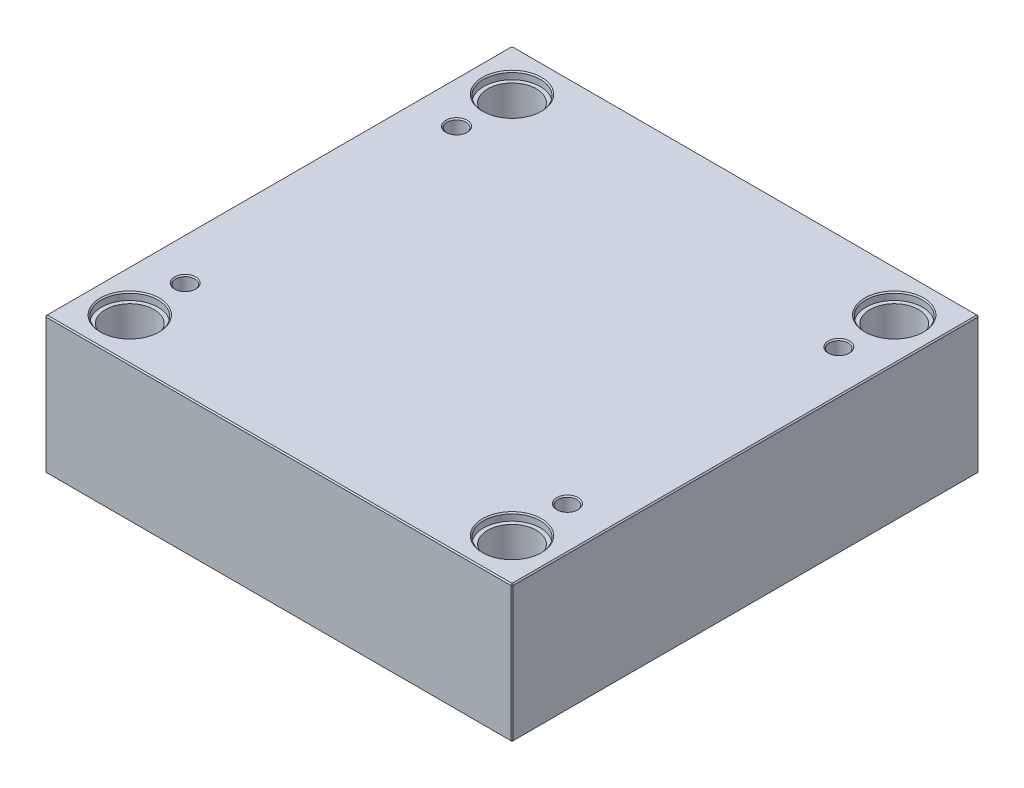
ISO-10303-21;
HEADER;
FILE_DESCRIPTION(('STEP AP214'),'2;1');
FILE_NAME('part.step','',(''),(''),'','','');
FILE_SCHEMA(('AUTOMOTIVE_DESIGN { 1 0 10303 214 1 1 1 1 }'));
ENDSEC;
DATA;
#1=APPLICATION_CONTEXT('core data for automotive mechanical design processes');
#2=APPLICATION_PROTOCOL_DEFINITION('international standard','automotive_design',2000,#1);
#3=PRODUCT_CONTEXT('',#1,'mechanical');
#4=PRODUCT('Part','Part','',(#3));
#5=PRODUCT_RELATED_PRODUCT_CATEGORY('part','',(#4));
#6=PRODUCT_DEFINITION_FORMATION('','',#4);
#7=PRODUCT_DEFINITION_CONTEXT('part definition',#1,'design');
#8=PRODUCT_DEFINITION('design','',#6,#7);
#9=PRODUCT_DEFINITION_SHAPE('','',#8);
#10=(LENGTH_UNIT() NAMED_UNIT(*) SI_UNIT(.MILLI.,.METRE.));
#11=(NAMED_UNIT(*) PLANE_ANGLE_UNIT() SI_UNIT($,.RADIAN.));
#12=(NAMED_UNIT(*) SI_UNIT($,.STERADIAN.) SOLID_ANGLE_UNIT());
#13=UNCERTAINTY_MEASURE_WITH_UNIT(LENGTH_MEASURE(1.E-05),#10,'distance_accuracy_value','');
#14=(GEOMETRIC_REPRESENTATION_CONTEXT(3) GLOBAL_UNCERTAINTY_ASSIGNED_CONTEXT((#13)) GLOBAL_UNIT_ASSIGNED_CONTEXT((#10,
#11,#12)) REPRESENTATION_CONTEXT('',''));
#15=CARTESIAN_POINT('',(0.,0.,0.));
#16=DIRECTION('',(0.,0.,1.));
#17=DIRECTION('',(1.,0.,0.));
#18=AXIS2_PLACEMENT_3D('',#15,#16,#17);
#19=CARTESIAN_POINT('',(-162.,0.,-162.));
#20=DIRECTION('',(0.,1.,0.));
#21=DIRECTION('',(0.,0.,1.));
#22=AXIS2_PLACEMENT_3D('',#19,#20,#21);
#23=CYLINDRICAL_SURFACE('',#22,20.65);
#24=CARTESIAN_POINT('',(-162.,0.999999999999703,-162.));
#25=DIRECTION('',(0.,1.,0.));
#26=DIRECTION('',(0.,0.,1.));
#27=AXIS2_PLACEMENT_3D('',#24,#25,#26);
#28=CIRCLE('',#27,20.65);
#29=CARTESIAN_POINT('',(-162.,0.999999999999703,-141.35));
#30=VERTEX_POINT('',#29);
#31=EDGE_CURVE('E472',#30,#30,#28,.F.);
#32=ORIENTED_EDGE('',*,*,#31,.T.);
#33=EDGE_LOOP('',(#32));
#34=FACE_BOUND('',#33,.T.);
#35=CARTESIAN_POINT('',(-162.,109.7,-162.));
#36=DIRECTION('',(0.,1.,0.));
#37=DIRECTION('',(0.,0.,1.));
#38=AXIS2_PLACEMENT_3D('',#35,#36,#37);
#39=CIRCLE('',#38,20.65);
#40=CARTESIAN_POINT('',(-162.,109.7,-141.35));
#41=VERTEX_POINT('',#40);
#42=EDGE_CURVE('E221',#41,#41,#39,.F.);
#43=ORIENTED_EDGE('',*,*,#42,.F.);
#44=EDGE_LOOP('',(#43));
#45=FACE_BOUND('',#44,.T.);
#46=ADVANCED_FACE('F16',(#34,#45),#23,.F.);
#47=CARTESIAN_POINT('',(162.,0.,-162.));
#48=DIRECTION('',(0.,1.,0.));
#49=DIRECTION('',(0.,0.,1.));
#50=AXIS2_PLACEMENT_3D('',#47,#48,#49);
#51=CYLINDRICAL_SURFACE('',#50,20.65);
#52=CARTESIAN_POINT('',(162.,0.999999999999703,-162.));
#53=DIRECTION('',(0.,1.,0.));
#54=DIRECTION('',(0.,0.,1.));
#55=AXIS2_PLACEMENT_3D('',#52,#53,#54);
#56=CIRCLE('',#55,20.65);
#57=CARTESIAN_POINT('',(162.,0.999999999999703,-141.35));
#58=VERTEX_POINT('',#57);
#59=EDGE_CURVE('E474',#58,#58,#56,.F.);
#60=ORIENTED_EDGE('',*,*,#59,.T.);
#61=EDGE_LOOP('',(#60));
#62=FACE_BOUND('',#61,.T.);
#63=CARTESIAN_POINT('',(162.,109.7,-162.));
#64=DIRECTION('',(0.,1.,0.));
#65=DIRECTION('',(0.,0.,1.));
#66=AXIS2_PLACEMENT_3D('',#63,#64,#65);
#67=CIRCLE('',#66,20.65);
#68=CARTESIAN_POINT('',(162.,109.7,-141.35));
#69=VERTEX_POINT('',#68);
#70=EDGE_CURVE('E218',#69,#69,#67,.F.);
#71=ORIENTED_EDGE('',*,*,#70,.F.);
#72=EDGE_LOOP('',(#71));
#73=FACE_BOUND('',#72,.T.);
#74=ADVANCED_FACE('F263',(#62,#73),#51,.F.);
#75=CARTESIAN_POINT('',(162.,0.,162.));
#76=DIRECTION('',(0.,1.,0.));
#77=DIRECTION('',(0.,0.,1.));
#78=AXIS2_PLACEMENT_3D('',#75,#76,#77);
#79=CYLINDRICAL_SURFACE('',#78,20.65);
#80=CARTESIAN_POINT('',(162.,0.999999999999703,162.));
#81=DIRECTION('',(0.,1.,0.));
#82=DIRECTION('',(0.,0.,1.));
#83=AXIS2_PLACEMENT_3D('',#80,#81,#82);
#84=CIRCLE('',#83,20.65);
#85=CARTESIAN_POINT('',(162.,0.999999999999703,182.65));
#86=VERTEX_POINT('',#85);
#87=EDGE_CURVE('E477',#86,#86,#84,.F.);
#88=ORIENTED_EDGE('',*,*,#87,.T.);
#89=EDGE_LOOP('',(#88));
#90=FACE_BOUND('',#89,.T.);
#91=CARTESIAN_POINT('',(162.,109.7,162.));
#92=DIRECTION('',(0.,1.,0.));
#93=DIRECTION('',(0.,0.,1.));
#94=AXIS2_PLACEMENT_3D('',#91,#92,#93);
#95=CIRCLE('',#94,20.65);
#96=CARTESIAN_POINT('',(162.,109.7,182.65));
#97=VERTEX_POINT('',#96);
#98=EDGE_CURVE('E214',#97,#97,#95,.F.);
#99=ORIENTED_EDGE('',*,*,#98,.F.);
#100=EDGE_LOOP('',(#99));
#101=FACE_BOUND('',#100,.T.);
#102=ADVANCED_FACE('F270',(#90,#101),#79,.F.);
#103=CARTESIAN_POINT('',(-162.,0.,162.));
#104=DIRECTION('',(0.,1.,0.));
#105=DIRECTION('',(0.,0.,1.));
#106=AXIS2_PLACEMENT_3D('',#103,#104,#105);
#107=CYLINDRICAL_SURFACE('',#106,20.65);
#108=CARTESIAN_POINT('',(-162.,0.999999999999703,162.));
#109=DIRECTION('',(0.,1.,0.));
#110=DIRECTION('',(0.,0.,1.));
#111=AXIS2_PLACEMENT_3D('',#108,#109,#110);
#112=CIRCLE('',#111,20.65);
#113=CARTESIAN_POINT('',(-162.,0.999999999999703,182.65));
#114=VERTEX_POINT('',#113);
#115=EDGE_CURVE('E480',#114,#114,#112,.F.);
#116=ORIENTED_EDGE('',*,*,#115,.T.);
#117=EDGE_LOOP('',(#116));
#118=FACE_BOUND('',#117,.T.);
#119=CARTESIAN_POINT('',(-162.,109.7,162.));
#120=DIRECTION('',(0.,1.,0.));
#121=DIRECTION('',(0.,0.,1.));
#122=AXIS2_PLACEMENT_3D('',#119,#120,#121);
#123=CIRCLE('',#122,20.65);
#124=CARTESIAN_POINT('',(-162.,109.7,182.65));
#125=VERTEX_POINT('',#124);
#126=EDGE_CURVE('E211',#125,#125,#123,.F.);
#127=ORIENTED_EDGE('',*,*,#126,.F.);
#128=EDGE_LOOP('',(#127));
#129=FACE_BOUND('',#128,.T.);
#130=ADVANCED_FACE('F277',(#118,#129),#107,.F.);
#131=CARTESIAN_POINT('',(-198.,116.,198.));
#132=DIRECTION('',(1.,0.,0.));
#133=DIRECTION('',(0.,0.,-1.));
#134=AXIS2_PLACEMENT_3D('',#131,#132,#133);
#135=PLANE('',#134);
#136=DIRECTION('',(0.,-1.,0.));
#137=VECTOR('',#136,1.);
#138=CARTESIAN_POINT('',(-198.,116.,-197.));
#139=LINE('',#138,#137);
#140=CARTESIAN_POINT('',(-198.,115.,-197.));
#141=VERTEX_POINT('',#140);
#142=CARTESIAN_POINT('',(-198.,1.,-197.));
#143=VERTEX_POINT('',#142);
#144=EDGE_CURVE('E487',#141,#143,#139,.T.);
#145=ORIENTED_EDGE('',*,*,#144,.T.);
#146=DIRECTION('',(0.,0.,1.));
#147=VECTOR('',#146,1.);
#148=CARTESIAN_POINT('',(-198.,1.,198.));
#149=LINE('',#148,#147);
#150=CARTESIAN_POINT('',(-198.,1.,197.));
#151=VERTEX_POINT('',#150);
#152=EDGE_CURVE('E490',#143,#151,#149,.T.);
#153=ORIENTED_EDGE('',*,*,#152,.T.);
#154=DIRECTION('',(0.,1.,0.));
#155=VECTOR('',#154,1.);
#156=CARTESIAN_POINT('',(-198.,116.,197.));
#157=LINE('',#156,#155);
#158=CARTESIAN_POINT('',(-198.,115.,197.));
#159=VERTEX_POINT('',#158);
#160=EDGE_CURVE('E485',#151,#159,#157,.T.);
#161=ORIENTED_EDGE('',*,*,#160,.T.);
#162=DIRECTION('',(0.,0.,-1.));
#163=VECTOR('',#162,1.);
#164=CARTESIAN_POINT('',(-198.,115.,-198.));
#165=LINE('',#164,#163);
#166=EDGE_CURVE('E483',#159,#141,#165,.T.);
#167=ORIENTED_EDGE('',*,*,#166,.T.);
#168=EDGE_LOOP('',(#145,#153,#161,#167));
#169=FACE_BOUND('',#168,.T.);
#170=ADVANCED_FACE('F298',(#169),#135,.F.);
#171=CARTESIAN_POINT('',(198.,116.,198.));
#172=DIRECTION('',(0.,0.,-1.));
#173=DIRECTION('',(-1.,0.,0.));
#174=AXIS2_PLACEMENT_3D('',#171,#172,#173);
#175=PLANE('',#174);
#176=DIRECTION('',(-1.,0.,0.));
#177=VECTOR('',#176,1.);
#178=CARTESIAN_POINT('',(-198.,115.,198.));
#179=LINE('',#178,#177);
#180=CARTESIAN_POINT('',(197.,115.,198.));
#181=VERTEX_POINT('',#180);
#182=CARTESIAN_POINT('',(-197.,115.,198.));
#183=VERTEX_POINT('',#182);
#184=EDGE_CURVE('E509',#181,#183,#179,.T.);
#185=ORIENTED_EDGE('',*,*,#184,.T.);
#186=DIRECTION('',(0.,-1.,0.));
#187=VECTOR('',#186,1.);
#188=CARTESIAN_POINT('',(-197.,116.,198.));
#189=LINE('',#188,#187);
#190=CARTESIAN_POINT('',(-197.,0.999999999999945,198.));
#191=VERTEX_POINT('',#190);
#192=EDGE_CURVE('E515',#183,#191,#189,.T.);
#193=ORIENTED_EDGE('',*,*,#192,.T.);
#194=DIRECTION('',(1.,0.,0.));
#195=VECTOR('',#194,1.);
#196=CARTESIAN_POINT('',(198.,0.999999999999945,198.));
#197=LINE('',#196,#195);
#198=CARTESIAN_POINT('',(197.,0.999999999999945,198.));
#199=VERTEX_POINT('',#198);
#200=EDGE_CURVE('E513',#191,#199,#197,.T.);
#201=ORIENTED_EDGE('',*,*,#200,.T.);
#202=DIRECTION('',(0.,1.,0.));
#203=VECTOR('',#202,1.);
#204=CARTESIAN_POINT('',(197.,116.,198.));
#205=LINE('',#204,#203);
#206=EDGE_CURVE('E511',#199,#181,#205,.T.);
#207=ORIENTED_EDGE('',*,*,#206,.T.);
#208=EDGE_LOOP('',(#185,#193,#201,#207));
#209=FACE_BOUND('',#208,.T.);
#210=ADVANCED_FACE('F294',(#209),#175,.F.);
#211=CARTESIAN_POINT('',(198.,116.,198.));
#212=DIRECTION('',(-1.,0.,0.));
#213=DIRECTION('',(0.,0.,1.));
#214=AXIS2_PLACEMENT_3D('',#211,#212,#213);
#215=PLANE('',#214);
#216=DIRECTION('',(0.,0.,-1.));
#217=VECTOR('',#216,1.);
#218=CARTESIAN_POINT('',(198.,0.999999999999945,198.));
#219=LINE('',#218,#217);
#220=CARTESIAN_POINT('',(198.,0.999999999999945,197.));
#221=VERTEX_POINT('',#220);
#222=CARTESIAN_POINT('',(198.,0.999999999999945,-197.));
#223=VERTEX_POINT('',#222);
#224=EDGE_CURVE('E504',#221,#223,#219,.T.);
#225=ORIENTED_EDGE('',*,*,#224,.T.);
#226=DIRECTION('',(0.,1.,0.));
#227=VECTOR('',#226,1.);
#228=CARTESIAN_POINT('',(198.,116.,-197.));
#229=LINE('',#228,#227);
#230=CARTESIAN_POINT('',(198.,115.,-197.));
#231=VERTEX_POINT('',#230);
#232=EDGE_CURVE('E506',#223,#231,#229,.T.);
#233=ORIENTED_EDGE('',*,*,#232,.T.);
#234=DIRECTION('',(0.,0.,1.));
#235=VECTOR('',#234,1.);
#236=CARTESIAN_POINT('',(198.,115.,198.));
#237=LINE('',#236,#235);
#238=CARTESIAN_POINT('',(198.,115.,197.));
#239=VERTEX_POINT('',#238);
#240=EDGE_CURVE('E500',#231,#239,#237,.T.);
#241=ORIENTED_EDGE('',*,*,#240,.T.);
#242=DIRECTION('',(0.,-1.,0.));
#243=VECTOR('',#242,1.);
#244=CARTESIAN_POINT('',(198.,116.,197.));
#245=LINE('',#244,#243);
#246=EDGE_CURVE('E502',#239,#221,#245,.T.);
#247=ORIENTED_EDGE('',*,*,#246,.T.);
#248=EDGE_LOOP('',(#225,#233,#241,#247));
#249=FACE_BOUND('',#248,.T.);
#250=ADVANCED_FACE('F290',(#249),#215,.F.);
#251=CARTESIAN_POINT('',(198.,116.,-198.));
#252=DIRECTION('',(0.,0.,1.));
#253=DIRECTION('',(1.,0.,0.));
#254=AXIS2_PLACEMENT_3D('',#251,#252,#253);
#255=PLANE('',#254);
#256=DIRECTION('',(0.,-1.,0.));
#257=VECTOR('',#256,1.);
#258=CARTESIAN_POINT('',(197.,116.,-198.));
#259=LINE('',#258,#257);
#260=CARTESIAN_POINT('',(197.,115.,-198.));
#261=VERTEX_POINT('',#260);
#262=CARTESIAN_POINT('',(197.,0.999999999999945,-198.));
#263=VERTEX_POINT('',#262);
#264=EDGE_CURVE('E494',#261,#263,#259,.T.);
#265=ORIENTED_EDGE('',*,*,#264,.T.);
#266=DIRECTION('',(-1.,0.,0.));
#267=VECTOR('',#266,1.);
#268=CARTESIAN_POINT('',(198.,0.999999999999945,-198.));
#269=LINE('',#268,#267);
#270=CARTESIAN_POINT('',(-197.,0.999999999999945,-198.));
#271=VERTEX_POINT('',#270);
#272=EDGE_CURVE('E138',#263,#271,#269,.T.);
#273=ORIENTED_EDGE('',*,*,#272,.T.);
#274=DIRECTION('',(0.,1.,0.));
#275=VECTOR('',#274,1.);
#276=CARTESIAN_POINT('',(-197.,116.,-198.));
#277=LINE('',#276,#275);
#278=CARTESIAN_POINT('',(-197.,115.,-198.));
#279=VERTEX_POINT('',#278);
#280=EDGE_CURVE('E496',#271,#279,#277,.T.);
#281=ORIENTED_EDGE('',*,*,#280,.T.);
#282=DIRECTION('',(1.,0.,0.));
#283=VECTOR('',#282,1.);
#284=CARTESIAN_POINT('',(198.,115.,-198.));
#285=LINE('',#284,#283);
#286=EDGE_CURVE('E492',#279,#261,#285,.T.);
#287=ORIENTED_EDGE('',*,*,#286,.T.);
#288=EDGE_LOOP('',(#265,#273,#281,#287));
#289=FACE_BOUND('',#288,.T.);
#290=ADVANCED_FACE('F282',(#289),#255,.F.);
#291=CARTESIAN_POINT('',(0.,116.,0.));
#292=DIRECTION('',(0.,1.,0.));
#293=DIRECTION('',(0.,0.,1.));
#294=AXIS2_PLACEMENT_3D('',#291,#292,#293);
#295=PLANE('',#294);
#296=CARTESIAN_POINT('',(162.,116.,162.));
#297=DIRECTION('',(0.,1.,0.));
#298=DIRECTION('',(0.,0.,1.));
#299=AXIS2_PLACEMENT_3D('',#296,#297,#298);
#300=CIRCLE('',#299,25.);
#301=CARTESIAN_POINT('',(162.,116.,187.));
#302=VERTEX_POINT('',#301);
#303=EDGE_CURVE('E236',#302,#302,#300,.F.);
#304=ORIENTED_EDGE('',*,*,#303,.T.);
#305=EDGE_LOOP('',(#304));
#306=FACE_BOUND('',#305,.T.);
#307=CARTESIAN_POINT('',(-162.,116.,162.));
#308=DIRECTION('',(0.,1.,0.));
#309=DIRECTION('',(0.,0.,1.));
#310=AXIS2_PLACEMENT_3D('',#307,#308,#309);
#311=CIRCLE('',#310,25.);
#312=CARTESIAN_POINT('',(-162.,116.,187.));
#313=VERTEX_POINT('',#312);
#314=EDGE_CURVE('E233',#313,#313,#311,.F.);
#315=ORIENTED_EDGE('',*,*,#314,.T.);
#316=EDGE_LOOP('',(#315));
#317=FACE_BOUND('',#316,.T.);
#318=CARTESIAN_POINT('',(162.,116.,-162.));
#319=DIRECTION('',(0.,1.,0.));
#320=DIRECTION('',(0.,0.,1.));
#321=AXIS2_PLACEMENT_3D('',#318,#319,#320);
#322=CIRCLE('',#321,25.);
#323=CARTESIAN_POINT('',(162.,116.,-137.));
#324=VERTEX_POINT('',#323);
#325=EDGE_CURVE('E230',#324,#324,#322,.F.);
#326=ORIENTED_EDGE('',*,*,#325,.T.);
#327=EDGE_LOOP('',(#326));
#328=FACE_BOUND('',#327,.T.);
#329=CARTESIAN_POINT('',(-162.,116.,-162.));
#330=DIRECTION('',(0.,1.,0.));
#331=DIRECTION('',(0.,0.,1.));
#332=AXIS2_PLACEMENT_3D('',#329,#330,#331);
#333=CIRCLE('',#332,25.);
#334=CARTESIAN_POINT('',(-162.,116.,-137.));
#335=VERTEX_POINT('',#334);
#336=EDGE_CURVE('E227',#335,#335,#333,.F.);
#337=ORIENTED_EDGE('',*,*,#336,.T.);
#338=EDGE_LOOP('',(#337));
#339=FACE_BOUND('',#338,.T.);
#340=CARTESIAN_POINT('',(-162.,116.,115.));
#341=DIRECTION('',(0.,1.,0.));
#342=DIRECTION('',(0.,0.,1.));
#343=AXIS2_PLACEMENT_3D('',#340,#341,#342);
#344=CIRCLE('',#343,9.);
#345=CARTESIAN_POINT('',(-162.,116.,124.));
#346=VERTEX_POINT('',#345);
#347=EDGE_CURVE('E198',#346,#346,#344,.F.);
#348=ORIENTED_EDGE('',*,*,#347,.T.);
#349=EDGE_LOOP('',(#348));
#350=FACE_BOUND('',#349,.T.);
#351=CARTESIAN_POINT('',(162.,116.,115.));
#352=DIRECTION('',(0.,1.,0.));
#353=DIRECTION('',(0.,0.,1.));
#354=AXIS2_PLACEMENT_3D('',#351,#352,#353);
#355=CIRCLE('',#354,9.);
#356=CARTESIAN_POINT('',(162.,116.,124.));
#357=VERTEX_POINT('',#356);
#358=EDGE_CURVE('E195',#357,#357,#355,.F.);
#359=ORIENTED_EDGE('',*,*,#358,.T.);
#360=EDGE_LOOP('',(#359));
#361=FACE_BOUND('',#360,.T.);
#362=CARTESIAN_POINT('',(162.,116.,-115.));
#363=DIRECTION('',(0.,1.,0.));
#364=DIRECTION('',(0.,0.,1.));
#365=AXIS2_PLACEMENT_3D('',#362,#363,#364);
#366=CIRCLE('',#365,9.);
#367=CARTESIAN_POINT('',(162.,116.,-106.));
#368=VERTEX_POINT('',#367);
#369=EDGE_CURVE('E192',#368,#368,#366,.F.);
#370=ORIENTED_EDGE('',*,*,#369,.T.);
#371=EDGE_LOOP('',(#370));
#372=FACE_BOUND('',#371,.T.);
#373=CARTESIAN_POINT('',(-162.,116.,-115.));
#374=DIRECTION('',(0.,1.,0.));
#375=DIRECTION('',(0.,0.,1.));
#376=AXIS2_PLACEMENT_3D('',#373,#374,#375);
#377=CIRCLE('',#376,9.);
#378=CARTESIAN_POINT('',(-162.,116.,-106.));
#379=VERTEX_POINT('',#378);
#380=EDGE_CURVE('E188',#379,#379,#377,.F.);
#381=ORIENTED_EDGE('',*,*,#380,.T.);
#382=EDGE_LOOP('',(#381));
#383=FACE_BOUND('',#382,.T.);
#384=DIRECTION('',(0.,0.,-1.));
#385=VECTOR('',#384,1.);
#386=CARTESIAN_POINT('',(197.,116.,-198.));
#387=LINE('',#386,#385);
#388=CARTESIAN_POINT('',(197.,116.,197.));
#389=VERTEX_POINT('',#388);
#390=CARTESIAN_POINT('',(197.,116.,-197.));
#391=VERTEX_POINT('',#390);
#392=EDGE_CURVE('E31',#389,#391,#387,.T.);
#393=ORIENTED_EDGE('',*,*,#392,.T.);
#394=DIRECTION('',(-1.,0.,0.));
#395=VECTOR('',#394,1.);
#396=CARTESIAN_POINT('',(-198.,116.,-197.));
#397=LINE('',#396,#395);
#398=CARTESIAN_POINT('',(-197.,116.,-197.));
#399=VERTEX_POINT('',#398);
#400=EDGE_CURVE('E189',#391,#399,#397,.T.);
#401=ORIENTED_EDGE('',*,*,#400,.T.);
#402=DIRECTION('',(0.,0.,1.));
#403=VECTOR('',#402,1.);
#404=CARTESIAN_POINT('',(-197.,116.,198.));
#405=LINE('',#404,#403);
#406=CARTESIAN_POINT('',(-197.,116.,197.));
#407=VERTEX_POINT('',#406);
#408=EDGE_CURVE('E518',#399,#407,#405,.T.);
#409=ORIENTED_EDGE('',*,*,#408,.T.);
#410=DIRECTION('',(1.,0.,0.));
#411=VECTOR('',#410,1.);
#412=CARTESIAN_POINT('',(198.,116.,197.));
#413=LINE('',#412,#411);
#414=EDGE_CURVE('E36',#407,#389,#413,.T.);
#415=ORIENTED_EDGE('',*,*,#414,.T.);
#416=EDGE_LOOP('',(#393,#401,#409,#415));
#417=FACE_BOUND('',#416,.T.);
#418=ADVANCED_FACE('F279',(#306,#317,#328,#339,#350,#361,#372,#383,#417),#295,.T.);
#419=CARTESIAN_POINT('',(0.,0.,0.));
#420=DIRECTION('',(0.,1.,0.));
#421=DIRECTION('',(0.,0.,1.));
#422=AXIS2_PLACEMENT_3D('',#419,#420,#421);
#423=PLANE('',#422);
#424=CARTESIAN_POINT('',(-162.,0.,-162.));
#425=DIRECTION('',(0.,1.,0.));
#426=DIRECTION('',(0.,0.,1.));
#427=AXIS2_PLACEMENT_3D('',#424,#425,#426);
#428=CIRCLE('',#427,21.6499999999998);
#429=CARTESIAN_POINT('',(-162.,0.,-140.35));
#430=VERTEX_POINT('',#429);
#431=EDGE_CURVE('E469',#430,#430,#428,.T.);
#432=ORIENTED_EDGE('',*,*,#431,.T.);
#433=EDGE_LOOP('',(#432));
#434=FACE_BOUND('',#433,.T.);
#435=CARTESIAN_POINT('',(162.,0.,-162.));
#436=DIRECTION('',(0.,1.,0.));
#437=DIRECTION('',(0.,0.,1.));
#438=AXIS2_PLACEMENT_3D('',#435,#436,#437);
#439=CIRCLE('',#438,21.6499999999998);
#440=CARTESIAN_POINT('',(162.,0.,-140.35));
#441=VERTEX_POINT('',#440);
#442=EDGE_CURVE('E466',#441,#441,#439,.T.);
#443=ORIENTED_EDGE('',*,*,#442,.T.);
#444=EDGE_LOOP('',(#443));
#445=FACE_BOUND('',#444,.T.);
#446=CARTESIAN_POINT('',(162.,0.,162.));
#447=DIRECTION('',(0.,1.,0.));
#448=DIRECTION('',(0.,0.,1.));
#449=AXIS2_PLACEMENT_3D('',#446,#447,#448);
#450=CIRCLE('',#449,21.6499999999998);
#451=CARTESIAN_POINT('',(162.,0.,183.65));
#452=VERTEX_POINT('',#451);
#453=EDGE_CURVE('E463',#452,#452,#450,.T.);
#454=ORIENTED_EDGE('',*,*,#453,.T.);
#455=EDGE_LOOP('',(#454));
#456=FACE_BOUND('',#455,.T.);
#457=CARTESIAN_POINT('',(-162.,0.,162.));
#458=DIRECTION('',(0.,1.,0.));
#459=DIRECTION('',(0.,0.,1.));
#460=AXIS2_PLACEMENT_3D('',#457,#458,#459);
#461=CIRCLE('',#460,21.6499999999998);
#462=CARTESIAN_POINT('',(-162.,0.,183.65));
#463=VERTEX_POINT('',#462);
#464=EDGE_CURVE('E460',#463,#463,#461,.T.);
#465=ORIENTED_EDGE('',*,*,#464,.T.);
#466=EDGE_LOOP('',(#465));
#467=FACE_BOUND('',#466,.T.);
#468=DIRECTION('',(0.,0.,1.));
#469=VECTOR('',#468,1.);
#470=CARTESIAN_POINT('',(197.,0.,0.));
#471=LINE('',#470,#469);
#472=CARTESIAN_POINT('',(197.,0.,-197.));
#473=VERTEX_POINT('',#472);
#474=CARTESIAN_POINT('',(197.,0.,197.));
#475=VERTEX_POINT('',#474);
#476=EDGE_CURVE('E108',#473,#475,#471,.T.);
#477=ORIENTED_EDGE('',*,*,#476,.T.);
#478=DIRECTION('',(-1.,0.,0.));
#479=VECTOR('',#478,1.);
#480=CARTESIAN_POINT('',(0.,0.,197.));
#481=LINE('',#480,#479);
#482=CARTESIAN_POINT('',(-197.,0.,197.));
#483=VERTEX_POINT('',#482);
#484=EDGE_CURVE('E458',#475,#483,#481,.T.);
#485=ORIENTED_EDGE('',*,*,#484,.T.);
#486=DIRECTION('',(0.,0.,-1.));
#487=VECTOR('',#486,1.);
#488=CARTESIAN_POINT('',(-197.,0.,0.));
#489=LINE('',#488,#487);
#490=CARTESIAN_POINT('',(-197.,0.,-197.));
#491=VERTEX_POINT('',#490);
#492=EDGE_CURVE('E110',#483,#491,#489,.T.);
#493=ORIENTED_EDGE('',*,*,#492,.T.);
#494=DIRECTION('',(1.,0.,0.));
#495=VECTOR('',#494,1.);
#496=CARTESIAN_POINT('',(0.,0.,-197.));
#497=LINE('',#496,#495);
#498=EDGE_CURVE('E104',#491,#473,#497,.T.);
#499=ORIENTED_EDGE('',*,*,#498,.T.);
#500=EDGE_LOOP('',(#477,#485,#493,#499));
#501=FACE_BOUND('',#500,.T.);
#502=ADVANCED_FACE('F106',(#434,#445,#456,#467,#501),#423,.F.);
#503=CARTESIAN_POINT('',(-162.,0.,-162.));
#504=DIRECTION('',(0.,-1.,0.));
#505=DIRECTION('',(0.,0.,-1.));
#506=AXIS2_PLACEMENT_3D('',#503,#504,#505);
#507=CONICAL_SURFACE('',#506,21.6499999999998,0.785398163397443);
#508=ORIENTED_EDGE('',*,*,#31,.F.);
#509=EDGE_LOOP('',(#508));
#510=FACE_BOUND('',#509,.T.);
#511=ORIENTED_EDGE('',*,*,#431,.F.);
#512=EDGE_LOOP('',(#511));
#513=FACE_BOUND('',#512,.T.);
#514=ADVANCED_FACE('F286',(#510,#513),#507,.F.);
#515=CARTESIAN_POINT('',(162.,0.,-162.));
#516=DIRECTION('',(0.,-1.,0.));
#517=DIRECTION('',(0.,0.,-1.));
#518=AXIS2_PLACEMENT_3D('',#515,#516,#517);
#519=CONICAL_SURFACE('',#518,21.6499999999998,0.785398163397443);
#520=ORIENTED_EDGE('',*,*,#59,.F.);
#521=EDGE_LOOP('',(#520));
#522=FACE_BOUND('',#521,.T.);
#523=ORIENTED_EDGE('',*,*,#442,.F.);
#524=EDGE_LOOP('',(#523));
#525=FACE_BOUND('',#524,.T.);
#526=ADVANCED_FACE('F305',(#522,#525),#519,.F.);
#527=CARTESIAN_POINT('',(162.,0.,162.));
#528=DIRECTION('',(0.,-1.,0.));
#529=DIRECTION('',(0.,0.,-1.));
#530=AXIS2_PLACEMENT_3D('',#527,#528,#529);
#531=CONICAL_SURFACE('',#530,21.6499999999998,0.785398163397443);
#532=ORIENTED_EDGE('',*,*,#87,.F.);
#533=EDGE_LOOP('',(#532));
#534=FACE_BOUND('',#533,.T.);
#535=ORIENTED_EDGE('',*,*,#453,.F.);
#536=EDGE_LOOP('',(#535));
#537=FACE_BOUND('',#536,.T.);
#538=ADVANCED_FACE('F309',(#534,#537),#531,.F.);
#539=CARTESIAN_POINT('',(-162.,0.,162.));
#540=DIRECTION('',(0.,-1.,0.));
#541=DIRECTION('',(0.,0.,-1.));
#542=AXIS2_PLACEMENT_3D('',#539,#540,#541);
#543=CONICAL_SURFACE('',#542,21.6499999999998,0.785398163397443);
#544=ORIENTED_EDGE('',*,*,#115,.F.);
#545=EDGE_LOOP('',(#544));
#546=FACE_BOUND('',#545,.T.);
#547=ORIENTED_EDGE('',*,*,#464,.F.);
#548=EDGE_LOOP('',(#547));
#549=FACE_BOUND('',#548,.T.);
#550=ADVANCED_FACE('F313',(#546,#549),#543,.F.);
#551=CARTESIAN_POINT('',(198.,116.,197.));
#552=DIRECTION('',(-0.707106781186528,0.,-0.707106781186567));
#553=DIRECTION('',(0.,-1.,0.));
#554=AXIS2_PLACEMENT_3D('',#551,#552,#553);
#555=PLANE('',#554);
#556=DIRECTION('',(-0.707106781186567,0.,0.707106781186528));
#557=VECTOR('',#556,1.);
#558=CARTESIAN_POINT('',(197.,115.,198.));
#559=LINE('',#558,#557);
#560=EDGE_CURVE('E126',#181,#239,#559,.F.);
#561=ORIENTED_EDGE('',*,*,#560,.F.);
#562=ORIENTED_EDGE('',*,*,#206,.F.);
#563=DIRECTION('',(0.707106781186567,0.,-0.707106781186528));
#564=VECTOR('',#563,1.);
#565=CARTESIAN_POINT('',(197.,0.999999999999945,198.));
#566=LINE('',#565,#564);
#567=EDGE_CURVE('E180',#221,#199,#566,.F.);
#568=ORIENTED_EDGE('',*,*,#567,.F.);
#569=ORIENTED_EDGE('',*,*,#246,.F.);
#570=EDGE_LOOP('',(#561,#562,#568,#569));
#571=FACE_BOUND('',#570,.T.);
#572=ADVANCED_FACE('F317',(#571),#555,.F.);
#573=CARTESIAN_POINT('',(197.,115.,198.));
#574=DIRECTION('',(0.577350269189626,0.577350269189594,0.577350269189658));
#575=DIRECTION('',(0.707106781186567,0.,-0.707106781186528));
#576=AXIS2_PLACEMENT_3D('',#573,#574,#575);
#577=PLANE('',#576);
#578=DIRECTION('',(0.,-0.707106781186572,0.707106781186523));
#579=VECTOR('',#578,1.);
#580=CARTESIAN_POINT('',(197.,115.,198.));
#581=LINE('',#580,#579);
#582=EDGE_CURVE('E175',#181,#389,#581,.F.);
#583=ORIENTED_EDGE('',*,*,#582,.F.);
#584=ORIENTED_EDGE('',*,*,#560,.T.);
#585=DIRECTION('',(-0.707106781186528,0.707106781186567,0.));
#586=VECTOR('',#585,1.);
#587=CARTESIAN_POINT('',(197.5,115.5,197.));
#588=LINE('',#587,#586);
#589=EDGE_CURVE('E177',#389,#239,#588,.F.);
#590=ORIENTED_EDGE('',*,*,#589,.F.);
#591=EDGE_LOOP('',(#583,#584,#590));
#592=FACE_BOUND('',#591,.T.);
#593=ADVANCED_FACE('F385',(#592),#577,.T.);
#594=CARTESIAN_POINT('',(197.,0.999999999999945,198.));
#595=DIRECTION('',(0.577350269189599,-0.577350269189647,0.577350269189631));
#596=DIRECTION('',(0.,-0.707106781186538,-0.707106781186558));
#597=AXIS2_PLACEMENT_3D('',#594,#595,#596);
#598=PLANE('',#597);
#599=DIRECTION('',(-0.707106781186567,-0.707106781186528,0.));
#600=VECTOR('',#599,1.);
#601=CARTESIAN_POINT('',(197.5,0.499999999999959,197.));
#602=LINE('',#601,#600);
#603=EDGE_CURVE('E124',#221,#475,#602,.T.);
#604=ORIENTED_EDGE('',*,*,#603,.F.);
#605=ORIENTED_EDGE('',*,*,#567,.T.);
#606=DIRECTION('',(0.,0.707106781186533,0.707106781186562));
#607=VECTOR('',#606,1.);
#608=CARTESIAN_POINT('',(197.,0.999999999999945,198.));
#609=LINE('',#608,#607);
#610=EDGE_CURVE('E172',#475,#199,#609,.T.);
#611=ORIENTED_EDGE('',*,*,#610,.F.);
#612=EDGE_LOOP('',(#604,#605,#611));
#613=FACE_BOUND('',#612,.T.);
#614=ADVANCED_FACE('F381',(#613),#598,.T.);
#615=CARTESIAN_POINT('',(197.,116.,0.));
#616=DIRECTION('',(0.707106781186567,0.707106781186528,0.));
#617=DIRECTION('',(0.,0.,1.));
#618=AXIS2_PLACEMENT_3D('',#615,#616,#617);
#619=PLANE('',#618);
#620=ORIENTED_EDGE('',*,*,#589,.T.);
#621=ORIENTED_EDGE('',*,*,#240,.F.);
#622=DIRECTION('',(0.707106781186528,-0.707106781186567,0.));
#623=VECTOR('',#622,1.);
#624=CARTESIAN_POINT('',(198.,115.,-197.));
#625=LINE('',#624,#623);
#626=EDGE_CURVE('E166',#391,#231,#625,.T.);
#627=ORIENTED_EDGE('',*,*,#626,.F.);
#628=ORIENTED_EDGE('',*,*,#392,.F.);
#629=EDGE_LOOP('',(#620,#621,#627,#628));
#630=FACE_BOUND('',#629,.T.);
#631=ADVANCED_FACE('F377',(#630),#619,.T.);
#632=CARTESIAN_POINT('',(0.,116.,197.));
#633=DIRECTION('',(0.,0.707106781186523,0.707106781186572));
#634=DIRECTION('',(-1.,0.,0.));
#635=AXIS2_PLACEMENT_3D('',#632,#633,#634);
#636=PLANE('',#635);
#637=ORIENTED_EDGE('',*,*,#582,.T.);
#638=ORIENTED_EDGE('',*,*,#414,.F.);
#639=DIRECTION('',(0.,0.707106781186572,-0.707106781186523));
#640=VECTOR('',#639,1.);
#641=CARTESIAN_POINT('',(-197.,115.5,197.5));
#642=LINE('',#641,#640);
#643=EDGE_CURVE('E163',#183,#407,#642,.T.);
#644=ORIENTED_EDGE('',*,*,#643,.F.);
#645=ORIENTED_EDGE('',*,*,#184,.F.);
#646=EDGE_LOOP('',(#637,#638,#644,#645));
#647=FACE_BOUND('',#646,.T.);
#648=ADVANCED_FACE('F373',(#647),#636,.T.);
#649=CARTESIAN_POINT('',(-197.,116.,198.));
#650=DIRECTION('',(0.707106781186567,0.,-0.707106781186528));
#651=DIRECTION('',(0.,-1.,0.));
#652=AXIS2_PLACEMENT_3D('',#649,#650,#651);
#653=PLANE('',#652);
#654=DIRECTION('',(0.707106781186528,0.,0.707106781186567));
#655=VECTOR('',#654,1.);
#656=CARTESIAN_POINT('',(-197.,0.999999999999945,198.));
#657=LINE('',#656,#655);
#658=EDGE_CURVE('E157',#191,#151,#657,.F.);
#659=ORIENTED_EDGE('',*,*,#658,.F.);
#660=ORIENTED_EDGE('',*,*,#192,.F.);
#661=DIRECTION('',(-0.707106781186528,0.,-0.707106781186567));
#662=VECTOR('',#661,1.);
#663=CARTESIAN_POINT('',(-198.,115.,197.));
#664=LINE('',#663,#662);
#665=EDGE_CURVE('E160',#159,#183,#664,.F.);
#666=ORIENTED_EDGE('',*,*,#665,.F.);
#667=ORIENTED_EDGE('',*,*,#160,.F.);
#668=EDGE_LOOP('',(#659,#660,#666,#667));
#669=FACE_BOUND('',#668,.T.);
#670=ADVANCED_FACE('F369',(#669),#653,.F.);
#671=CARTESIAN_POINT('',(198.,0.999999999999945,198.));
#672=DIRECTION('',(0.,0.707106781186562,-0.707106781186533));
#673=DIRECTION('',(1.,0.,0.));
#674=AXIS2_PLACEMENT_3D('',#671,#672,#673);
#675=PLANE('',#674);
#676=ORIENTED_EDGE('',*,*,#610,.T.);
#677=ORIENTED_EDGE('',*,*,#200,.F.);
#678=DIRECTION('',(0.,-0.707106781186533,-0.707106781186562));
#679=VECTOR('',#678,1.);
#680=CARTESIAN_POINT('',(-197.,0.999999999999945,198.));
#681=LINE('',#680,#679);
#682=EDGE_CURVE('E135',#483,#191,#681,.F.);
#683=ORIENTED_EDGE('',*,*,#682,.F.);
#684=ORIENTED_EDGE('',*,*,#484,.F.);
#685=EDGE_LOOP('',(#676,#677,#683,#684));
#686=FACE_BOUND('',#685,.T.);
#687=ADVANCED_FACE('F366',(#686),#675,.F.);
#688=CARTESIAN_POINT('',(198.,0.999999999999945,198.));
#689=DIRECTION('',(-0.707106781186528,0.707106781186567,0.));
#690=DIRECTION('',(0.,0.,-1.));
#691=AXIS2_PLACEMENT_3D('',#688,#689,#690);
#692=PLANE('',#691);
#693=ORIENTED_EDGE('',*,*,#603,.T.);
#694=ORIENTED_EDGE('',*,*,#476,.F.);
#695=DIRECTION('',(0.707106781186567,0.707106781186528,0.));
#696=VECTOR('',#695,1.);
#697=CARTESIAN_POINT('',(197.5,0.499999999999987,-197.));
#698=LINE('',#697,#696);
#699=EDGE_CURVE('E121',#223,#473,#698,.F.);
#700=ORIENTED_EDGE('',*,*,#699,.F.);
#701=ORIENTED_EDGE('',*,*,#224,.F.);
#702=EDGE_LOOP('',(#693,#694,#700,#701));
#703=FACE_BOUND('',#702,.T.);
#704=ADVANCED_FACE('F119',(#703),#692,.F.);
#705=CARTESIAN_POINT('',(197.,116.,-198.));
#706=DIRECTION('',(-0.707106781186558,0.,0.707106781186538));
#707=DIRECTION('',(0.,-1.,0.));
#708=AXIS2_PLACEMENT_3D('',#705,#706,#707);
#709=PLANE('',#708);
#710=DIRECTION('',(0.707106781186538,0.,0.707106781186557));
#711=VECTOR('',#710,1.);
#712=CARTESIAN_POINT('',(198.,115.,-197.));
#713=LINE('',#712,#711);
#714=EDGE_CURVE('E168',#231,#261,#713,.F.);
#715=ORIENTED_EDGE('',*,*,#714,.F.);
#716=ORIENTED_EDGE('',*,*,#232,.F.);
#717=DIRECTION('',(-0.707106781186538,0.,-0.707106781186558));
#718=VECTOR('',#717,1.);
#719=CARTESIAN_POINT('',(197.,0.999999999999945,-198.));
#720=LINE('',#719,#718);
#721=EDGE_CURVE('E134',#263,#223,#720,.F.);
#722=ORIENTED_EDGE('',*,*,#721,.F.);
#723=ORIENTED_EDGE('',*,*,#264,.F.);
#724=EDGE_LOOP('',(#715,#716,#722,#723));
#725=FACE_BOUND('',#724,.T.);
#726=ADVANCED_FACE('F359',(#725),#709,.F.);
#727=CARTESIAN_POINT('',(198.,115.,-197.));
#728=DIRECTION('',(0.577350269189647,0.577350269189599,-0.577350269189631));
#729=DIRECTION('',(-0.707106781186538,0.,-0.707106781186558));
#730=AXIS2_PLACEMENT_3D('',#727,#728,#729);
#731=PLANE('',#730);
#732=ORIENTED_EDGE('',*,*,#626,.T.);
#733=ORIENTED_EDGE('',*,*,#714,.T.);
#734=DIRECTION('',(0.,0.707106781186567,0.707106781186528));
#735=VECTOR('',#734,1.);
#736=CARTESIAN_POINT('',(197.,115.5,-197.5));
#737=LINE('',#736,#735);
#738=EDGE_CURVE('E152',#391,#261,#737,.F.);
#739=ORIENTED_EDGE('',*,*,#738,.F.);
#740=EDGE_LOOP('',(#732,#733,#739));
#741=FACE_BOUND('',#740,.T.);
#742=ADVANCED_FACE('F355',(#741),#731,.T.);
#743=CARTESIAN_POINT('',(-198.,115.,197.));
#744=DIRECTION('',(-0.577350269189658,0.577350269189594,0.577350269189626));
#745=DIRECTION('',(0.707106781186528,0.,0.707106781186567));
#746=AXIS2_PLACEMENT_3D('',#743,#744,#745);
#747=PLANE('',#746);
#748=ORIENTED_EDGE('',*,*,#665,.T.);
#749=ORIENTED_EDGE('',*,*,#643,.T.);
#750=DIRECTION('',(-0.707106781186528,-0.707106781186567,0.));
#751=VECTOR('',#750,1.);
#752=CARTESIAN_POINT('',(-198.,115.,197.));
#753=LINE('',#752,#751);
#754=EDGE_CURVE('E143',#159,#407,#753,.F.);
#755=ORIENTED_EDGE('',*,*,#754,.F.);
#756=EDGE_LOOP('',(#748,#749,#755));
#757=FACE_BOUND('',#756,.T.);
#758=ADVANCED_FACE('F351',(#757),#747,.T.);
#759=CARTESIAN_POINT('',(-197.,0.999999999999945,198.));
#760=DIRECTION('',(-0.577350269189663,-0.577350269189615,0.577350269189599));
#761=DIRECTION('',(0.707106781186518,-0.707106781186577,0.));
#762=AXIS2_PLACEMENT_3D('',#759,#760,#761);
#763=PLANE('',#762);
#764=ORIENTED_EDGE('',*,*,#682,.T.);
#765=ORIENTED_EDGE('',*,*,#658,.T.);
#766=DIRECTION('',(-0.707106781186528,0.707106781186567,0.));
#767=VECTOR('',#766,1.);
#768=CARTESIAN_POINT('',(-197.5,0.499999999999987,197.));
#769=LINE('',#768,#767);
#770=EDGE_CURVE('E139',#483,#151,#769,.T.);
#771=ORIENTED_EDGE('',*,*,#770,.F.);
#772=EDGE_LOOP('',(#764,#765,#771));
#773=FACE_BOUND('',#772,.T.);
#774=ADVANCED_FACE('F348',(#773),#763,.T.);
#775=CARTESIAN_POINT('',(197.,0.999999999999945,-198.));
#776=DIRECTION('',(0.577350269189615,-0.577350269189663,-0.577350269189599));
#777=DIRECTION('',(0.707106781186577,0.707106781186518,0.));
#778=AXIS2_PLACEMENT_3D('',#775,#776,#777);
#779=PLANE('',#778);
#780=ORIENTED_EDGE('',*,*,#721,.T.);
#781=ORIENTED_EDGE('',*,*,#699,.T.);
#782=DIRECTION('',(0.,-0.707106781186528,0.707106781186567));
#783=VECTOR('',#782,1.);
#784=CARTESIAN_POINT('',(197.,0.999999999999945,-198.));
#785=LINE('',#784,#783);
#786=EDGE_CURVE('E131',#263,#473,#785,.T.);
#787=ORIENTED_EDGE('',*,*,#786,.F.);
#788=EDGE_LOOP('',(#780,#781,#787));
#789=FACE_BOUND('',#788,.T.);
#790=ADVANCED_FACE('F130',(#789),#779,.T.);
#791=CARTESIAN_POINT('',(0.,116.,-197.));
#792=DIRECTION('',(0.,0.707106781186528,-0.707106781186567));
#793=DIRECTION('',(1.,0.,0.));
#794=AXIS2_PLACEMENT_3D('',#791,#792,#793);
#795=PLANE('',#794);
#796=ORIENTED_EDGE('',*,*,#738,.T.);
#797=ORIENTED_EDGE('',*,*,#286,.F.);
#798=DIRECTION('',(0.,-0.707106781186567,-0.707106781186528));
#799=VECTOR('',#798,1.);
#800=CARTESIAN_POINT('',(-197.,115.,-198.));
#801=LINE('',#800,#799);
#802=EDGE_CURVE('E140',#399,#279,#801,.T.);
#803=ORIENTED_EDGE('',*,*,#802,.F.);
#804=ORIENTED_EDGE('',*,*,#400,.F.);
#805=EDGE_LOOP('',(#796,#797,#803,#804));
#806=FACE_BOUND('',#805,.T.);
#807=ADVANCED_FACE('F341',(#806),#795,.T.);
#808=CARTESIAN_POINT('',(-197.,116.,0.));
#809=DIRECTION('',(-0.707106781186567,0.707106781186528,0.));
#810=DIRECTION('',(0.,0.,-1.));
#811=AXIS2_PLACEMENT_3D('',#808,#809,#810);
#812=PLANE('',#811);
#813=ORIENTED_EDGE('',*,*,#754,.T.);
#814=ORIENTED_EDGE('',*,*,#408,.F.);
#815=DIRECTION('',(0.707106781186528,0.707106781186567,0.));
#816=VECTOR('',#815,1.);
#817=CARTESIAN_POINT('',(-197.5,115.5,-197.));
#818=LINE('',#817,#816);
#819=EDGE_CURVE('E146',#141,#399,#818,.T.);
#820=ORIENTED_EDGE('',*,*,#819,.F.);
#821=ORIENTED_EDGE('',*,*,#166,.F.);
#822=EDGE_LOOP('',(#813,#814,#820,#821));
#823=FACE_BOUND('',#822,.T.);
#824=ADVANCED_FACE('F337',(#823),#812,.T.);
#825=CARTESIAN_POINT('',(-198.,1.,198.));
#826=DIRECTION('',(0.707106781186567,0.707106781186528,0.));
#827=DIRECTION('',(0.,0.,1.));
#828=AXIS2_PLACEMENT_3D('',#825,#826,#827);
#829=PLANE('',#828);
#830=ORIENTED_EDGE('',*,*,#770,.T.);
#831=ORIENTED_EDGE('',*,*,#152,.F.);
#832=DIRECTION('',(0.707106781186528,-0.707106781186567,0.));
#833=VECTOR('',#832,1.);
#834=CARTESIAN_POINT('',(-198.,1.,-197.));
#835=LINE('',#834,#833);
#836=EDGE_CURVE('E529',#491,#143,#835,.F.);
#837=ORIENTED_EDGE('',*,*,#836,.F.);
#838=ORIENTED_EDGE('',*,*,#492,.F.);
#839=EDGE_LOOP('',(#830,#831,#837,#838));
#840=FACE_BOUND('',#839,.T.);
#841=ADVANCED_FACE('F334',(#840),#829,.F.);
#842=CARTESIAN_POINT('',(198.,0.999999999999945,-198.));
#843=DIRECTION('',(0.,0.707106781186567,0.707106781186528));
#844=DIRECTION('',(-1.,0.,0.));
#845=AXIS2_PLACEMENT_3D('',#842,#843,#844);
#846=PLANE('',#845);
#847=ORIENTED_EDGE('',*,*,#786,.T.);
#848=ORIENTED_EDGE('',*,*,#498,.F.);
#849=DIRECTION('',(0.,0.707106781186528,-0.707106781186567));
#850=VECTOR('',#849,1.);
#851=CARTESIAN_POINT('',(-197.,0.499999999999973,-197.5));
#852=LINE('',#851,#850);
#853=EDGE_CURVE('E526',#271,#491,#852,.F.);
#854=ORIENTED_EDGE('',*,*,#853,.F.);
#855=ORIENTED_EDGE('',*,*,#272,.F.);
#856=EDGE_LOOP('',(#847,#848,#854,#855));
#857=FACE_BOUND('',#856,.T.);
#858=ADVANCED_FACE('F137',(#857),#846,.F.);
#859=CARTESIAN_POINT('',(-197.,115.,-198.));
#860=DIRECTION('',(-0.577350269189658,0.577350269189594,-0.577350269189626));
#861=DIRECTION('',(-0.707106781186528,0.,0.707106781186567));
#862=AXIS2_PLACEMENT_3D('',#859,#860,#861);
#863=PLANE('',#862);
#864=ORIENTED_EDGE('',*,*,#819,.T.);
#865=ORIENTED_EDGE('',*,*,#802,.T.);
#866=DIRECTION('',(0.707106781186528,0.,-0.707106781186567));
#867=VECTOR('',#866,1.);
#868=CARTESIAN_POINT('',(-197.,115.,-198.));
#869=LINE('',#868,#867);
#870=EDGE_CURVE('E524',#141,#279,#869,.T.);
#871=ORIENTED_EDGE('',*,*,#870,.F.);
#872=EDGE_LOOP('',(#864,#865,#871));
#873=FACE_BOUND('',#872,.T.);
#874=ADVANCED_FACE('F327',(#873),#863,.T.);
#875=CARTESIAN_POINT('',(-198.,1.,-197.));
#876=DIRECTION('',(-0.577350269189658,-0.577350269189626,-0.577350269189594));
#877=DIRECTION('',(0.707106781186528,-0.707106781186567,0.));
#878=AXIS2_PLACEMENT_3D('',#875,#876,#877);
#879=PLANE('',#878);
#880=ORIENTED_EDGE('',*,*,#853,.T.);
#881=ORIENTED_EDGE('',*,*,#836,.T.);
#882=DIRECTION('',(-0.707106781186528,0.,0.707106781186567));
#883=VECTOR('',#882,1.);
#884=CARTESIAN_POINT('',(-198.,1.,-197.));
#885=LINE('',#884,#883);
#886=EDGE_CURVE('E455',#271,#143,#885,.T.);
#887=ORIENTED_EDGE('',*,*,#886,.F.);
#888=EDGE_LOOP('',(#880,#881,#887));
#889=FACE_BOUND('',#888,.T.);
#890=ADVANCED_FACE('F323',(#889),#879,.T.);
#891=CARTESIAN_POINT('',(-198.,116.,-197.));
#892=DIRECTION('',(0.707106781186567,0.,0.707106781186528));
#893=DIRECTION('',(0.,-1.,0.));
#894=AXIS2_PLACEMENT_3D('',#891,#892,#893);
#895=PLANE('',#894);
#896=ORIENTED_EDGE('',*,*,#870,.T.);
#897=ORIENTED_EDGE('',*,*,#280,.F.);
#898=ORIENTED_EDGE('',*,*,#886,.T.);
#899=ORIENTED_EDGE('',*,*,#144,.F.);
#900=EDGE_LOOP('',(#896,#897,#898,#899));
#901=FACE_BOUND('',#900,.T.);
#902=ADVANCED_FACE('F319',(#901),#895,.F.);
#903=CARTESIAN_POINT('',(-162.,91.,-115.));
#904=DIRECTION('',(0.,1.,0.));
#905=DIRECTION('',(0.,0.,1.));
#906=AXIS2_PLACEMENT_3D('',#903,#904,#905);
#907=CYLINDRICAL_SURFACE('',#906,8.);
#908=CARTESIAN_POINT('',(-162.,115.,-115.));
#909=DIRECTION('',(0.,1.,0.));
#910=DIRECTION('',(0.,0.,1.));
#911=AXIS2_PLACEMENT_3D('',#908,#909,#910);
#912=CIRCLE('',#911,8.);
#913=CARTESIAN_POINT('',(-162.,115.,-107.));
#914=VERTEX_POINT('',#913);
#915=EDGE_CURVE('E207',#914,#914,#912,.T.);
#916=ORIENTED_EDGE('',*,*,#915,.T.);
#917=EDGE_LOOP('',(#916));
#918=FACE_BOUND('',#917,.T.);
#919=CARTESIAN_POINT('',(-162.,91.,-115.));
#920=DIRECTION('',(0.,1.,0.));
#921=DIRECTION('',(0.,0.,1.));
#922=AXIS2_PLACEMENT_3D('',#919,#920,#921);
#923=CIRCLE('',#922,8.);
#924=CARTESIAN_POINT('',(-162.,91.,-107.));
#925=VERTEX_POINT('',#924);
#926=EDGE_CURVE('E448',#925,#925,#923,.T.);
#927=ORIENTED_EDGE('',*,*,#926,.F.);
#928=EDGE_LOOP('',(#927));
#929=FACE_BOUND('',#928,.T.);
#930=ADVANCED_FACE('F322',(#918,#929),#907,.F.);
#931=CARTESIAN_POINT('',(-162.,91.,-115.));
#932=DIRECTION('',(0.,1.,0.));
#933=DIRECTION('',(0.,0.,1.));
#934=AXIS2_PLACEMENT_3D('',#931,#932,#933);
#935=PLANE('',#934);
#936=ORIENTED_EDGE('',*,*,#926,.T.);
#937=EDGE_LOOP('',(#936));
#938=FACE_BOUND('',#937,.T.);
#939=ADVANCED_FACE('F596',(#938),#935,.T.);
#940=CARTESIAN_POINT('',(162.,91.,-115.));
#941=DIRECTION('',(0.,1.,0.));
#942=DIRECTION('',(0.,0.,1.));
#943=AXIS2_PLACEMENT_3D('',#940,#941,#942);
#944=CYLINDRICAL_SURFACE('',#943,8.);
#945=CARTESIAN_POINT('',(162.,115.,-115.));
#946=DIRECTION('',(0.,1.,0.));
#947=DIRECTION('',(0.,0.,1.));
#948=AXIS2_PLACEMENT_3D('',#945,#946,#947);
#949=CIRCLE('',#948,8.);
#950=CARTESIAN_POINT('',(162.,115.,-107.));
#951=VERTEX_POINT('',#950);
#952=EDGE_CURVE('E204',#951,#951,#949,.T.);
#953=ORIENTED_EDGE('',*,*,#952,.T.);
#954=EDGE_LOOP('',(#953));
#955=FACE_BOUND('',#954,.T.);
#956=CARTESIAN_POINT('',(162.,91.,-115.));
#957=DIRECTION('',(0.,1.,0.));
#958=DIRECTION('',(0.,0.,1.));
#959=AXIS2_PLACEMENT_3D('',#956,#957,#958);
#960=CIRCLE('',#959,8.);
#961=CARTESIAN_POINT('',(162.,91.,-107.));
#962=VERTEX_POINT('',#961);
#963=EDGE_CURVE('E445',#962,#962,#960,.T.);
#964=ORIENTED_EDGE('',*,*,#963,.F.);
#965=EDGE_LOOP('',(#964));
#966=FACE_BOUND('',#965,.T.);
#967=ADVANCED_FACE('F592',(#955,#966),#944,.F.);
#968=CARTESIAN_POINT('',(162.,91.,-115.));
#969=DIRECTION('',(0.,1.,0.));
#970=DIRECTION('',(0.,0.,1.));
#971=AXIS2_PLACEMENT_3D('',#968,#969,#970);
#972=PLANE('',#971);
#973=ORIENTED_EDGE('',*,*,#963,.T.);
#974=EDGE_LOOP('',(#973));
#975=FACE_BOUND('',#974,.T.);
#976=ADVANCED_FACE('F588',(#975),#972,.T.);
#977=CARTESIAN_POINT('',(162.,91.,115.));
#978=DIRECTION('',(0.,1.,0.));
#979=DIRECTION('',(0.,0.,1.));
#980=AXIS2_PLACEMENT_3D('',#977,#978,#979);
#981=CYLINDRICAL_SURFACE('',#980,8.);
#982=CARTESIAN_POINT('',(162.,115.,115.));
#983=DIRECTION('',(0.,1.,0.));
#984=DIRECTION('',(0.,0.,1.));
#985=AXIS2_PLACEMENT_3D('',#982,#983,#984);
#986=CIRCLE('',#985,8.);
#987=CARTESIAN_POINT('',(162.,115.,123.));
#988=VERTEX_POINT('',#987);
#989=EDGE_CURVE('E201',#988,#988,#986,.T.);
#990=ORIENTED_EDGE('',*,*,#989,.T.);
#991=EDGE_LOOP('',(#990));
#992=FACE_BOUND('',#991,.T.);
#993=CARTESIAN_POINT('',(162.,91.,115.));
#994=DIRECTION('',(0.,1.,0.));
#995=DIRECTION('',(0.,0.,1.));
#996=AXIS2_PLACEMENT_3D('',#993,#994,#995);
#997=CIRCLE('',#996,8.);
#998=CARTESIAN_POINT('',(162.,91.,123.));
#999=VERTEX_POINT('',#998);
#1000=EDGE_CURVE('E449',#999,#999,#997,.T.);
#1001=ORIENTED_EDGE('',*,*,#1000,.F.);
#1002=EDGE_LOOP('',(#1001));
#1003=FACE_BOUND('',#1002,.T.);
#1004=ADVANCED_FACE('F591',(#992,#1003),#981,.F.);
#1005=CARTESIAN_POINT('',(162.,91.,115.));
#1006=DIRECTION('',(0.,1.,0.));
#1007=DIRECTION('',(0.,0.,1.));
#1008=AXIS2_PLACEMENT_3D('',#1005,#1006,#1007);
#1009=PLANE('',#1008);
#1010=ORIENTED_EDGE('',*,*,#1000,.T.);
#1011=EDGE_LOOP('',(#1010));
#1012=FACE_BOUND('',#1011,.T.);
#1013=ADVANCED_FACE('F598',(#1012),#1009,.T.);
#1014=CARTESIAN_POINT('',(-162.,91.,115.));
#1015=DIRECTION('',(0.,1.,0.));
#1016=DIRECTION('',(0.,0.,1.));
#1017=AXIS2_PLACEMENT_3D('',#1014,#1015,#1016);
#1018=CYLINDRICAL_SURFACE('',#1017,8.);
#1019=CARTESIAN_POINT('',(-162.,115.,115.));
#1020=DIRECTION('',(0.,1.,0.));
#1021=DIRECTION('',(0.,0.,1.));
#1022=AXIS2_PLACEMENT_3D('',#1019,#1020,#1021);
#1023=CIRCLE('',#1022,8.);
#1024=CARTESIAN_POINT('',(-162.,115.,123.));
#1025=VERTEX_POINT('',#1024);
#1026=EDGE_CURVE('E185',#1025,#1025,#1023,.T.);
#1027=ORIENTED_EDGE('',*,*,#1026,.T.);
#1028=EDGE_LOOP('',(#1027));
#1029=FACE_BOUND('',#1028,.T.);
#1030=CARTESIAN_POINT('',(-162.,91.,115.));
#1031=DIRECTION('',(0.,1.,0.));
#1032=DIRECTION('',(0.,0.,1.));
#1033=AXIS2_PLACEMENT_3D('',#1030,#1031,#1032);
#1034=CIRCLE('',#1033,8.);
#1035=CARTESIAN_POINT('',(-162.,91.,123.));
#1036=VERTEX_POINT('',#1035);
#1037=EDGE_CURVE('E224',#1036,#1036,#1034,.T.);
#1038=ORIENTED_EDGE('',*,*,#1037,.F.);
#1039=EDGE_LOOP('',(#1038));
#1040=FACE_BOUND('',#1039,.T.);
#1041=ADVANCED_FACE('F601',(#1029,#1040),#1018,.F.);
#1042=CARTESIAN_POINT('',(-162.,91.,115.));
#1043=DIRECTION('',(0.,1.,0.));
#1044=DIRECTION('',(0.,0.,1.));
#1045=AXIS2_PLACEMENT_3D('',#1042,#1043,#1044);
#1046=PLANE('',#1045);
#1047=ORIENTED_EDGE('',*,*,#1037,.T.);
#1048=EDGE_LOOP('',(#1047));
#1049=FACE_BOUND('',#1048,.T.);
#1050=ADVANCED_FACE('F397',(#1049),#1046,.T.);
#1051=CARTESIAN_POINT('',(-162.,115.,115.));
#1052=DIRECTION('',(0.,1.,0.));
#1053=DIRECTION('',(0.,0.,1.));
#1054=AXIS2_PLACEMENT_3D('',#1051,#1052,#1053);
#1055=CONICAL_SURFACE('',#1054,8.,0.785398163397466);
#1056=ORIENTED_EDGE('',*,*,#347,.F.);
#1057=EDGE_LOOP('',(#1056));
#1058=FACE_BOUND('',#1057,.T.);
#1059=ORIENTED_EDGE('',*,*,#1026,.F.);
#1060=EDGE_LOOP('',(#1059));
#1061=FACE_BOUND('',#1060,.T.);
#1062=ADVANCED_FACE('F393',(#1058,#1061),#1055,.F.);
#1063=CARTESIAN_POINT('',(162.,115.,115.));
#1064=DIRECTION('',(0.,1.,0.));
#1065=DIRECTION('',(0.,0.,1.));
#1066=AXIS2_PLACEMENT_3D('',#1063,#1064,#1065);
#1067=CONICAL_SURFACE('',#1066,8.,0.785398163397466);
#1068=ORIENTED_EDGE('',*,*,#358,.F.);
#1069=EDGE_LOOP('',(#1068));
#1070=FACE_BOUND('',#1069,.T.);
#1071=ORIENTED_EDGE('',*,*,#989,.F.);
#1072=EDGE_LOOP('',(#1071));
#1073=FACE_BOUND('',#1072,.T.);
#1074=ADVANCED_FACE('F396',(#1070,#1073),#1067,.F.);
#1075=CARTESIAN_POINT('',(162.,115.,-115.));
#1076=DIRECTION('',(0.,1.,0.));
#1077=DIRECTION('',(0.,0.,1.));
#1078=AXIS2_PLACEMENT_3D('',#1075,#1076,#1077);
#1079=CONICAL_SURFACE('',#1078,8.,0.785398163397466);
#1080=ORIENTED_EDGE('',*,*,#369,.F.);
#1081=EDGE_LOOP('',(#1080));
#1082=FACE_BOUND('',#1081,.T.);
#1083=ORIENTED_EDGE('',*,*,#952,.F.);
#1084=EDGE_LOOP('',(#1083));
#1085=FACE_BOUND('',#1084,.T.);
#1086=ADVANCED_FACE('F401',(#1082,#1085),#1079,.F.);
#1087=CARTESIAN_POINT('',(-162.,115.,-115.));
#1088=DIRECTION('',(0.,1.,0.));
#1089=DIRECTION('',(0.,0.,1.));
#1090=AXIS2_PLACEMENT_3D('',#1087,#1088,#1089);
#1091=CONICAL_SURFACE('',#1090,8.,0.785398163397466);
#1092=ORIENTED_EDGE('',*,*,#380,.F.);
#1093=EDGE_LOOP('',(#1092));
#1094=FACE_BOUND('',#1093,.T.);
#1095=ORIENTED_EDGE('',*,*,#915,.F.);
#1096=EDGE_LOOP('',(#1095));
#1097=FACE_BOUND('',#1096,.T.);
#1098=ADVANCED_FACE('F405',(#1094,#1097),#1091,.F.);
#1099=CARTESIAN_POINT('',(-162.,109.7,162.));
#1100=DIRECTION('',(0.,1.,0.));
#1101=DIRECTION('',(0.,0.,1.));
#1102=AXIS2_PLACEMENT_3D('',#1099,#1100,#1101);
#1103=PLANE('',#1102);
#1104=CARTESIAN_POINT('',(-162.,109.7,162.));
#1105=DIRECTION('',(0.,1.,0.));
#1106=DIRECTION('',(0.,0.,1.));
#1107=AXIS2_PLACEMENT_3D('',#1104,#1105,#1106);
#1108=CIRCLE('',#1107,24.);
#1109=CARTESIAN_POINT('',(-162.,109.7,186.));
#1110=VERTEX_POINT('',#1109);
#1111=EDGE_CURVE('E436',#1110,#1110,#1108,.T.);
#1112=ORIENTED_EDGE('',*,*,#1111,.T.);
#1113=EDGE_LOOP('',(#1112));
#1114=FACE_BOUND('',#1113,.T.);
#1115=ORIENTED_EDGE('',*,*,#126,.T.);
#1116=EDGE_LOOP('',(#1115));
#1117=FACE_BOUND('',#1116,.T.);
#1118=ADVANCED_FACE('F409',(#1114,#1117),#1103,.T.);
#1119=CARTESIAN_POINT('',(-162.,109.7,162.));
#1120=DIRECTION('',(0.,1.,0.));
#1121=DIRECTION('',(0.,0.,1.));
#1122=AXIS2_PLACEMENT_3D('',#1119,#1120,#1121);
#1123=CYLINDRICAL_SURFACE('',#1122,24.);
#1124=CARTESIAN_POINT('',(-162.,115.,162.));
#1125=DIRECTION('',(0.,1.,0.));
#1126=DIRECTION('',(0.,0.,1.));
#1127=AXIS2_PLACEMENT_3D('',#1124,#1125,#1126);
#1128=CIRCLE('',#1127,24.);
#1129=CARTESIAN_POINT('',(-162.,115.,186.));
#1130=VERTEX_POINT('',#1129);
#1131=EDGE_CURVE('E239',#1130,#1130,#1128,.T.);
#1132=ORIENTED_EDGE('',*,*,#1131,.T.);
#1133=EDGE_LOOP('',(#1132));
#1134=FACE_BOUND('',#1133,.T.);
#1135=ORIENTED_EDGE('',*,*,#1111,.F.);
#1136=EDGE_LOOP('',(#1135));
#1137=FACE_BOUND('',#1136,.T.);
#1138=ADVANCED_FACE('F574',(#1134,#1137),#1123,.F.);
#1139=CARTESIAN_POINT('',(162.,109.7,162.));
#1140=DIRECTION('',(0.,1.,0.));
#1141=DIRECTION('',(0.,0.,1.));
#1142=AXIS2_PLACEMENT_3D('',#1139,#1140,#1141);
#1143=PLANE('',#1142);
#1144=CARTESIAN_POINT('',(162.,109.7,162.));
#1145=DIRECTION('',(0.,1.,0.));
#1146=DIRECTION('',(0.,0.,1.));
#1147=AXIS2_PLACEMENT_3D('',#1144,#1145,#1146);
#1148=CIRCLE('',#1147,24.);
#1149=CARTESIAN_POINT('',(162.,109.7,186.));
#1150=VERTEX_POINT('',#1149);
#1151=EDGE_CURVE('E433',#1150,#1150,#1148,.T.);
#1152=ORIENTED_EDGE('',*,*,#1151,.T.);
#1153=EDGE_LOOP('',(#1152));
#1154=FACE_BOUND('',#1153,.T.);
#1155=ORIENTED_EDGE('',*,*,#98,.T.);
#1156=EDGE_LOOP('',(#1155));
#1157=FACE_BOUND('',#1156,.T.);
#1158=ADVANCED_FACE('F429',(#1154,#1157),#1143,.T.);
#1159=CARTESIAN_POINT('',(162.,109.7,162.));
#1160=DIRECTION('',(0.,1.,0.));
#1161=DIRECTION('',(0.,0.,1.));
#1162=AXIS2_PLACEMENT_3D('',#1159,#1160,#1161);
#1163=CYLINDRICAL_SURFACE('',#1162,24.);
#1164=CARTESIAN_POINT('',(162.,115.,162.));
#1165=DIRECTION('',(0.,1.,0.));
#1166=DIRECTION('',(0.,0.,1.));
#1167=AXIS2_PLACEMENT_3D('',#1164,#1165,#1166);
#1168=CIRCLE('',#1167,24.);
#1169=CARTESIAN_POINT('',(162.,115.,186.));
#1170=VERTEX_POINT('',#1169);
#1171=EDGE_CURVE('E210',#1170,#1170,#1168,.T.);
#1172=ORIENTED_EDGE('',*,*,#1171,.T.);
#1173=EDGE_LOOP('',(#1172));
#1174=FACE_BOUND('',#1173,.T.);
#1175=ORIENTED_EDGE('',*,*,#1151,.F.);
#1176=EDGE_LOOP('',(#1175));
#1177=FACE_BOUND('',#1176,.T.);
#1178=ADVANCED_FACE('F425',(#1174,#1177),#1163,.F.);
#1179=CARTESIAN_POINT('',(162.,109.7,-162.));
#1180=DIRECTION('',(0.,1.,0.));
#1181=DIRECTION('',(0.,0.,1.));
#1182=AXIS2_PLACEMENT_3D('',#1179,#1180,#1181);
#1183=PLANE('',#1182);
#1184=CARTESIAN_POINT('',(162.,109.7,-162.));
#1185=DIRECTION('',(0.,1.,0.));
#1186=DIRECTION('',(0.,0.,1.));
#1187=AXIS2_PLACEMENT_3D('',#1184,#1185,#1186);
#1188=CIRCLE('',#1187,24.);
#1189=CARTESIAN_POINT('',(162.,109.7,-138.));
#1190=VERTEX_POINT('',#1189);
#1191=EDGE_CURVE('E435',#1190,#1190,#1188,.T.);
#1192=ORIENTED_EDGE('',*,*,#1191,.T.);
#1193=EDGE_LOOP('',(#1192));
#1194=FACE_BOUND('',#1193,.T.);
#1195=ORIENTED_EDGE('',*,*,#70,.T.);
#1196=EDGE_LOOP('',(#1195));
#1197=FACE_BOUND('',#1196,.T.);
#1198=ADVANCED_FACE('F428',(#1194,#1197),#1183,.T.);
#1199=CARTESIAN_POINT('',(162.,109.7,-162.));
#1200=DIRECTION('',(0.,1.,0.));
#1201=DIRECTION('',(0.,0.,1.));
#1202=AXIS2_PLACEMENT_3D('',#1199,#1200,#1201);
#1203=CYLINDRICAL_SURFACE('',#1202,24.);
#1204=CARTESIAN_POINT('',(162.,115.,-162.));
#1205=DIRECTION('',(0.,1.,0.));
#1206=DIRECTION('',(0.,0.,1.));
#1207=AXIS2_PLACEMENT_3D('',#1204,#1205,#1206);
#1208=CIRCLE('',#1207,24.);
#1209=CARTESIAN_POINT('',(162.,115.,-138.));
#1210=VERTEX_POINT('',#1209);
#1211=EDGE_CURVE('E24',#1210,#1210,#1208,.T.);
#1212=ORIENTED_EDGE('',*,*,#1211,.T.);
#1213=EDGE_LOOP('',(#1212));
#1214=FACE_BOUND('',#1213,.T.);
#1215=ORIENTED_EDGE('',*,*,#1191,.F.);
#1216=EDGE_LOOP('',(#1215));
#1217=FACE_BOUND('',#1216,.T.);
#1218=ADVANCED_FACE('F244',(#1214,#1217),#1203,.F.);
#1219=CARTESIAN_POINT('',(-162.,109.7,-162.));
#1220=DIRECTION('',(0.,1.,0.));
#1221=DIRECTION('',(0.,0.,1.));
#1222=AXIS2_PLACEMENT_3D('',#1219,#1220,#1221);
#1223=PLANE('',#1222);
#1224=CARTESIAN_POINT('',(-162.,109.7,-162.));
#1225=DIRECTION('',(0.,1.,0.));
#1226=DIRECTION('',(0.,0.,1.));
#1227=AXIS2_PLACEMENT_3D('',#1224,#1225,#1226);
#1228=CIRCLE('',#1227,24.);
#1229=CARTESIAN_POINT('',(-162.,109.7,-138.));
#1230=VERTEX_POINT('',#1229);
#1231=EDGE_CURVE('E215',#1230,#1230,#1228,.T.);
#1232=ORIENTED_EDGE('',*,*,#1231,.T.);
#1233=EDGE_LOOP('',(#1232));
#1234=FACE_BOUND('',#1233,.T.);
#1235=ORIENTED_EDGE('',*,*,#42,.T.);
#1236=EDGE_LOOP('',(#1235));
#1237=FACE_BOUND('',#1236,.T.);
#1238=ADVANCED_FACE('F418',(#1234,#1237),#1223,.T.);
#1239=CARTESIAN_POINT('',(-162.,109.7,-162.));
#1240=DIRECTION('',(0.,1.,0.));
#1241=DIRECTION('',(0.,0.,1.));
#1242=AXIS2_PLACEMENT_3D('',#1239,#1240,#1241);
#1243=CYLINDRICAL_SURFACE('',#1242,24.);
#1244=CARTESIAN_POINT('',(-162.,115.,-162.));
#1245=DIRECTION('',(0.,1.,0.));
#1246=DIRECTION('',(0.,0.,1.));
#1247=AXIS2_PLACEMENT_3D('',#1244,#1245,#1246);
#1248=CIRCLE('',#1247,24.);
#1249=CARTESIAN_POINT('',(-162.,115.,-138.));
#1250=VERTEX_POINT('',#1249);
#1251=EDGE_CURVE('E10',#1250,#1250,#1248,.T.);
#1252=ORIENTED_EDGE('',*,*,#1251,.T.);
#1253=EDGE_LOOP('',(#1252));
#1254=FACE_BOUND('',#1253,.T.);
#1255=ORIENTED_EDGE('',*,*,#1231,.F.);
#1256=EDGE_LOOP('',(#1255));
#1257=FACE_BOUND('',#1256,.T.);
#1258=ADVANCED_FACE('F412',(#1254,#1257),#1243,.F.);
#1259=CARTESIAN_POINT('',(162.,115.,162.));
#1260=DIRECTION('',(0.,1.,0.));
#1261=DIRECTION('',(0.,0.,1.));
#1262=AXIS2_PLACEMENT_3D('',#1259,#1260,#1261);
#1263=CONICAL_SURFACE('',#1262,24.,0.785398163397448);
#1264=ORIENTED_EDGE('',*,*,#303,.F.);
#1265=EDGE_LOOP('',(#1264));
#1266=FACE_BOUND('',#1265,.T.);
#1267=ORIENTED_EDGE('',*,*,#1171,.F.);
#1268=EDGE_LOOP('',(#1267));
#1269=FACE_BOUND('',#1268,.T.);
#1270=ADVANCED_FACE('F258',(#1266,#1269),#1263,.F.);
#1271=CARTESIAN_POINT('',(-162.,115.,162.));
#1272=DIRECTION('',(0.,1.,0.));
#1273=DIRECTION('',(0.,0.,1.));
#1274=AXIS2_PLACEMENT_3D('',#1271,#1272,#1273);
#1275=CONICAL_SURFACE('',#1274,24.,0.785398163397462);
#1276=ORIENTED_EDGE('',*,*,#314,.F.);
#1277=EDGE_LOOP('',(#1276));
#1278=FACE_BOUND('',#1277,.T.);
#1279=ORIENTED_EDGE('',*,*,#1131,.F.);
#1280=EDGE_LOOP('',(#1279));
#1281=FACE_BOUND('',#1280,.T.);
#1282=ADVANCED_FACE('F249',(#1278,#1281),#1275,.F.);
#1283=CARTESIAN_POINT('',(162.,115.,-162.));
#1284=DIRECTION('',(0.,1.,0.));
#1285=DIRECTION('',(0.,0.,1.));
#1286=AXIS2_PLACEMENT_3D('',#1283,#1284,#1285);
#1287=CONICAL_SURFACE('',#1286,24.,0.785398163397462);
#1288=ORIENTED_EDGE('',*,*,#325,.F.);
#1289=EDGE_LOOP('',(#1288));
#1290=FACE_BOUND('',#1289,.T.);
#1291=ORIENTED_EDGE('',*,*,#1211,.F.);
#1292=EDGE_LOOP('',(#1291));
#1293=FACE_BOUND('',#1292,.T.);
#1294=ADVANCED_FACE('F247',(#1290,#1293),#1287,.F.);
#1295=CARTESIAN_POINT('',(-162.,115.,-162.));
#1296=DIRECTION('',(0.,1.,0.));
#1297=DIRECTION('',(0.,0.,1.));
#1298=AXIS2_PLACEMENT_3D('',#1295,#1296,#1297);
#1299=CONICAL_SURFACE('',#1298,24.,0.785398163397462);
#1300=ORIENTED_EDGE('',*,*,#336,.F.);
#1301=EDGE_LOOP('',(#1300));
#1302=FACE_BOUND('',#1301,.T.);
#1303=ORIENTED_EDGE('',*,*,#1251,.F.);
#1304=EDGE_LOOP('',(#1303));
#1305=FACE_BOUND('',#1304,.T.);
#1306=ADVANCED_FACE('F18',(#1302,#1305),#1299,.F.);
#1307=CLOSED_SHELL('',(#46,#74,#102,#130,#170,#210,#250,#290,#418,#502,#514,#526,#538,#550,#572,
#593,#614,#631,#648,#670,#687,#704,#726,#742,#758,#774,#790,#807,#824,#841,#858,#874,#890,#902,
#930,#939,#967,#976,#1004,#1013,#1041,#1050,#1062,#1074,#1086,#1098,#1118,#1138,#1158,#1178,
#1198,#1218,#1238,#1258,#1270,#1282,#1294,#1306));
#1308=MANIFOLD_SOLID_BREP('B1',#1307);
#1309=ADVANCED_BREP_SHAPE_REPRESENTATION('',(#18,#1308),#14);
#1310=SHAPE_DEFINITION_REPRESENTATION(#9,#1309);
ENDSEC;
END-ISO-10303-21;
